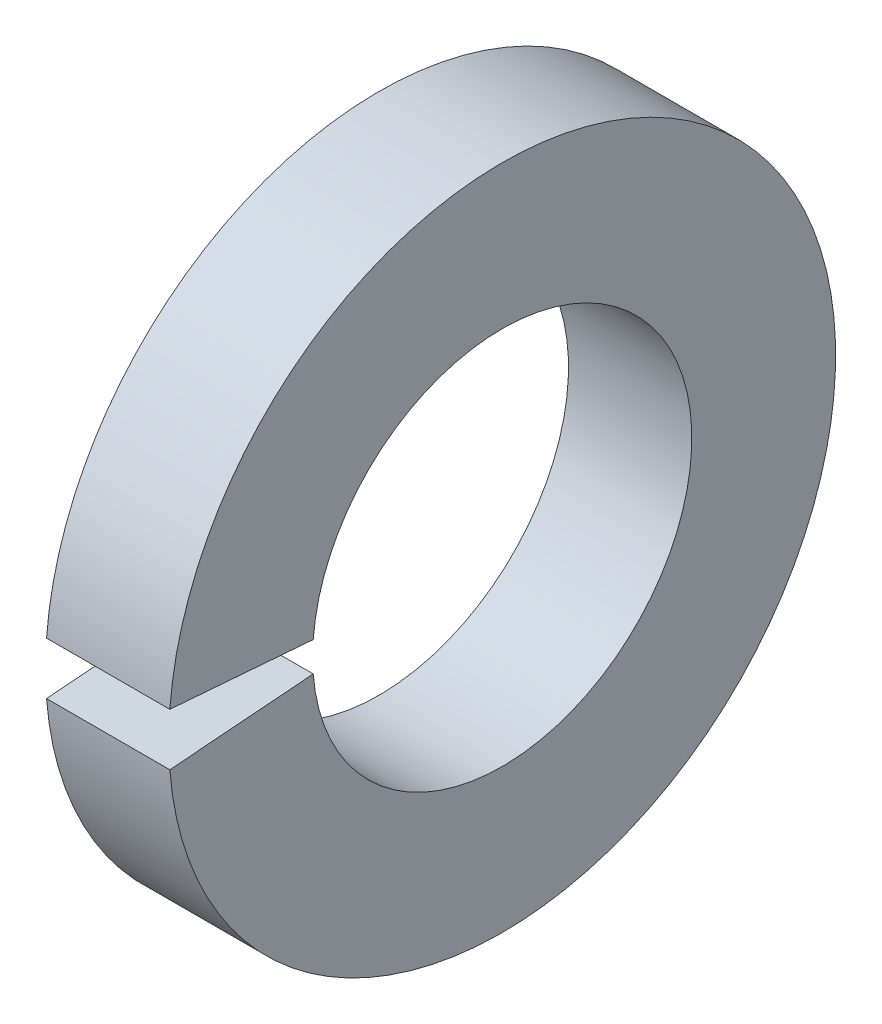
ISO-10303-21;
HEADER;
FILE_DESCRIPTION(('STEP AP214'),'2;1');
FILE_NAME('part.step','',(''),(''),'','','');
FILE_SCHEMA(('AUTOMOTIVE_DESIGN { 1 0 10303 214 1 1 1 1 }'));
ENDSEC;
DATA;
#1=APPLICATION_CONTEXT('core data for automotive mechanical design processes');
#2=APPLICATION_PROTOCOL_DEFINITION('international standard','automotive_design',2000,#1);
#3=PRODUCT_CONTEXT('',#1,'mechanical');
#4=PRODUCT('Part','Part','',(#3));
#5=PRODUCT_RELATED_PRODUCT_CATEGORY('part','',(#4));
#6=PRODUCT_DEFINITION_FORMATION('','',#4);
#7=PRODUCT_DEFINITION_CONTEXT('part definition',#1,'design');
#8=PRODUCT_DEFINITION('design','',#6,#7);
#9=PRODUCT_DEFINITION_SHAPE('','',#8);
#10=(LENGTH_UNIT() NAMED_UNIT(*) SI_UNIT(.MILLI.,.METRE.));
#11=(NAMED_UNIT(*) PLANE_ANGLE_UNIT() SI_UNIT($,.RADIAN.));
#12=(NAMED_UNIT(*) SI_UNIT($,.STERADIAN.) SOLID_ANGLE_UNIT());
#13=UNCERTAINTY_MEASURE_WITH_UNIT(LENGTH_MEASURE(1.E-05),#10,'distance_accuracy_value','');
#14=(GEOMETRIC_REPRESENTATION_CONTEXT(3) GLOBAL_UNCERTAINTY_ASSIGNED_CONTEXT((#13)) GLOBAL_UNIT_ASSIGNED_CONTEXT((#10,
#11,#12)) REPRESENTATION_CONTEXT('',''));
#15=CARTESIAN_POINT('',(0.,0.,0.));
#16=DIRECTION('',(0.,0.,1.));
#17=DIRECTION('',(1.,0.,0.));
#18=AXIS2_PLACEMENT_3D('',#15,#16,#17);
#19=CARTESIAN_POINT('',(-34.9249999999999,0.,0.));
#20=DIRECTION('',(-1.,0.,0.));
#21=DIRECTION('',(0.,0.,1.));
#22=AXIS2_PLACEMENT_3D('',#19,#20,#21);
#23=CYLINDRICAL_SURFACE('',#22,12.8905);
#24=CARTESIAN_POINT('',(0.,0.,0.));
#25=DIRECTION('',(-1.,0.,0.));
#26=DIRECTION('',(0.,0.,1.));
#27=AXIS2_PLACEMENT_3D('',#24,#25,#26);
#28=CIRCLE('',#27,12.8905);
#29=CARTESIAN_POINT('',(0.,1.01137697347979,12.8507628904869));
#30=VERTEX_POINT('',#29);
#31=CARTESIAN_POINT('',(0.,-1.01137697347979,12.8507628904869));
#32=VERTEX_POINT('',#31);
#33=EDGE_CURVE('E84',#30,#32,#28,.T.);
#34=ORIENTED_EDGE('',*,*,#33,.F.);
#35=DIRECTION('',(-1.,0.,0.));
#36=VECTOR('',#35,1.);
#37=CARTESIAN_POINT('',(-34.9249999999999,1.01137697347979,12.8507628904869));
#38=LINE('',#37,#36);
#39=CARTESIAN_POINT('',(-8.382,1.01137697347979,12.8507628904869));
#40=VERTEX_POINT('',#39);
#41=EDGE_CURVE('E98',#30,#40,#38,.T.);
#42=ORIENTED_EDGE('',*,*,#41,.T.);
#43=CARTESIAN_POINT('',(-8.382,0.,0.));
#44=DIRECTION('',(-1.,0.,0.));
#45=DIRECTION('',(0.,0.,1.));
#46=AXIS2_PLACEMENT_3D('',#43,#44,#45);
#47=CIRCLE('',#46,12.8905);
#48=CARTESIAN_POINT('',(-8.382,-1.01137697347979,12.8507628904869));
#49=VERTEX_POINT('',#48);
#50=EDGE_CURVE('E86',#40,#49,#47,.T.);
#51=ORIENTED_EDGE('',*,*,#50,.T.);
#52=DIRECTION('',(-1.,0.,0.));
#53=VECTOR('',#52,1.);
#54=CARTESIAN_POINT('',(-34.9249999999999,-1.01137697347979,12.8507628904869));
#55=LINE('',#54,#53);
#56=EDGE_CURVE('E54',#32,#49,#55,.T.);
#57=ORIENTED_EDGE('',*,*,#56,.F.);
#58=EDGE_LOOP('',(#34,#42,#51,#57));
#59=FACE_BOUND('',#58,.T.);
#60=ADVANCED_FACE('F33',(#59),#23,.F.);
#61=CARTESIAN_POINT('',(0.,12.8905,0.));
#62=DIRECTION('',(-1.,0.,0.));
#63=DIRECTION('',(0.,0.,1.));
#64=AXIS2_PLACEMENT_3D('',#61,#62,#63);
#65=PLANE('',#64);
#66=CARTESIAN_POINT('',(0.,0.,0.));
#67=DIRECTION('',(-1.,0.,0.));
#68=DIRECTION('',(0.,0.,1.));
#69=AXIS2_PLACEMENT_3D('',#66,#67,#68);
#70=CIRCLE('',#69,22.6695);
#71=CARTESIAN_POINT('',(0.,1.7786284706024,22.5996174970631));
#72=VERTEX_POINT('',#71);
#73=CARTESIAN_POINT('',(0.,-1.7786284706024,22.5996174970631));
#74=VERTEX_POINT('',#73);
#75=EDGE_CURVE('E90',#72,#74,#70,.T.);
#76=ORIENTED_EDGE('',*,*,#75,.F.);
#77=DIRECTION('',(0.,0.0784590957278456,0.996917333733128));
#78=VECTOR('',#77,1.);
#79=CARTESIAN_POINT('',(0.,0.,0.));
#80=LINE('',#79,#78);
#81=EDGE_CURVE('E78',#30,#72,#80,.T.);
#82=ORIENTED_EDGE('',*,*,#81,.F.);
#83=ORIENTED_EDGE('',*,*,#33,.T.);
#84=DIRECTION('',(0.,-0.0784590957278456,0.996917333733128));
#85=VECTOR('',#84,1.);
#86=CARTESIAN_POINT('',(0.,0.,0.));
#87=LINE('',#86,#85);
#88=EDGE_CURVE('E70',#32,#74,#87,.T.);
#89=ORIENTED_EDGE('',*,*,#88,.T.);
#90=EDGE_LOOP('',(#76,#82,#83,#89));
#91=FACE_BOUND('',#90,.T.);
#92=ADVANCED_FACE('F89',(#91),#65,.F.);
#93=CARTESIAN_POINT('',(-34.9249999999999,0.,0.));
#94=DIRECTION('',(-1.,0.,0.));
#95=DIRECTION('',(0.,0.,1.));
#96=AXIS2_PLACEMENT_3D('',#93,#94,#95);
#97=CYLINDRICAL_SURFACE('',#96,22.6695);
#98=CARTESIAN_POINT('',(-8.382,0.,0.));
#99=DIRECTION('',(-1.,0.,0.));
#100=DIRECTION('',(0.,0.,1.));
#101=AXIS2_PLACEMENT_3D('',#98,#99,#100);
#102=CIRCLE('',#101,22.6695);
#103=CARTESIAN_POINT('',(-8.382,1.7786284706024,22.5996174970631));
#104=VERTEX_POINT('',#103);
#105=CARTESIAN_POINT('',(-8.382,-1.7786284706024,22.5996174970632));
#106=VERTEX_POINT('',#105);
#107=EDGE_CURVE('E92',#104,#106,#102,.T.);
#108=ORIENTED_EDGE('',*,*,#107,.F.);
#109=DIRECTION('',(-1.,0.,0.));
#110=VECTOR('',#109,1.);
#111=CARTESIAN_POINT('',(-34.9249999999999,1.7786284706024,22.5996174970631));
#112=LINE('',#111,#110);
#113=EDGE_CURVE('E47',#104,#72,#112,.F.);
#114=ORIENTED_EDGE('',*,*,#113,.T.);
#115=ORIENTED_EDGE('',*,*,#75,.T.);
#116=DIRECTION('',(-1.,0.,0.));
#117=VECTOR('',#116,1.);
#118=CARTESIAN_POINT('',(-34.9249999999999,-1.7786284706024,22.5996174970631));
#119=LINE('',#118,#117);
#120=EDGE_CURVE('E73',#106,#74,#119,.F.);
#121=ORIENTED_EDGE('',*,*,#120,.F.);
#122=EDGE_LOOP('',(#108,#114,#115,#121));
#123=FACE_BOUND('',#122,.T.);
#124=ADVANCED_FACE('F105',(#123),#97,.T.);
#125=CARTESIAN_POINT('',(-8.382,22.6695,0.));
#126=DIRECTION('',(1.,0.,0.));
#127=DIRECTION('',(0.,0.,-1.));
#128=AXIS2_PLACEMENT_3D('',#125,#126,#127);
#129=PLANE('',#128);
#130=ORIENTED_EDGE('',*,*,#50,.F.);
#131=DIRECTION('',(0.,0.0784590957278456,0.996917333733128));
#132=VECTOR('',#131,1.);
#133=CARTESIAN_POINT('',(-8.382,0.139549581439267,1.77314555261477));
#134=LINE('',#133,#132);
#135=EDGE_CURVE('E11',#40,#104,#134,.T.);
#136=ORIENTED_EDGE('',*,*,#135,.T.);
#137=ORIENTED_EDGE('',*,*,#107,.T.);
#138=DIRECTION('',(0.,-0.0784590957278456,0.996917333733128));
#139=VECTOR('',#138,1.);
#140=CARTESIAN_POINT('',(-8.382,0.139549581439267,-1.77314555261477));
#141=LINE('',#140,#139);
#142=EDGE_CURVE('E40',#49,#106,#141,.T.);
#143=ORIENTED_EDGE('',*,*,#142,.F.);
#144=EDGE_LOOP('',(#130,#136,#137,#143));
#145=FACE_BOUND('',#144,.T.);
#146=ADVANCED_FACE('F107',(#145),#129,.F.);
#147=CARTESIAN_POINT('',(-8.382,0.,0.));
#148=DIRECTION('',(0.,0.996917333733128,0.0784590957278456));
#149=DIRECTION('',(0.,-0.0784590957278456,0.996917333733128));
#150=AXIS2_PLACEMENT_3D('',#147,#148,#149);
#151=PLANE('',#150);
#152=ORIENTED_EDGE('',*,*,#56,.T.);
#153=ORIENTED_EDGE('',*,*,#142,.T.);
#154=ORIENTED_EDGE('',*,*,#120,.T.);
#155=ORIENTED_EDGE('',*,*,#88,.F.);
#156=EDGE_LOOP('',(#152,#153,#154,#155));
#157=FACE_BOUND('',#156,.T.);
#158=ADVANCED_FACE('F71',(#157),#151,.T.);
#159=CARTESIAN_POINT('',(-8.382,0.,0.));
#160=DIRECTION('',(0.,0.996917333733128,-0.0784590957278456));
#161=DIRECTION('',(0.,0.0784590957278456,0.996917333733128));
#162=AXIS2_PLACEMENT_3D('',#159,#160,#161);
#163=PLANE('',#162);
#164=ORIENTED_EDGE('',*,*,#81,.T.);
#165=ORIENTED_EDGE('',*,*,#113,.F.);
#166=ORIENTED_EDGE('',*,*,#135,.F.);
#167=ORIENTED_EDGE('',*,*,#41,.F.);
#168=EDGE_LOOP('',(#164,#165,#166,#167));
#169=FACE_BOUND('',#168,.T.);
#170=ADVANCED_FACE('F102',(#169),#163,.F.);
#171=CLOSED_SHELL('',(#60,#92,#124,#146,#158,#170));
#172=MANIFOLD_SOLID_BREP('B2',#171);
#173=ADVANCED_BREP_SHAPE_REPRESENTATION('',(#18,#172),#14);
#174=SHAPE_DEFINITION_REPRESENTATION(#9,#173);
ENDSEC;
END-ISO-10303-21;
